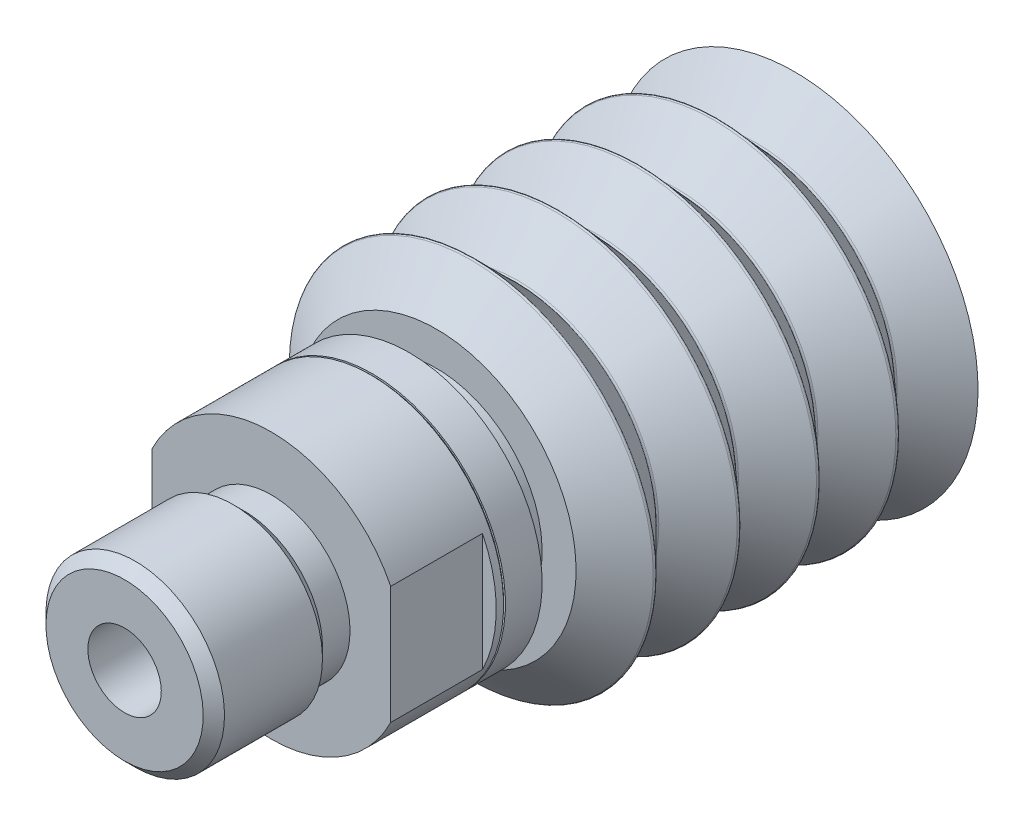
ISO-10303-21;
HEADER;
FILE_DESCRIPTION(('STEP AP214'),'2;1');
FILE_NAME('part.step','',(''),(''),'','','');
FILE_SCHEMA(('AUTOMOTIVE_DESIGN { 1 0 10303 214 1 1 1 1 }'));
ENDSEC;
DATA;
#1=APPLICATION_CONTEXT('core data for automotive mechanical design processes');
#2=APPLICATION_PROTOCOL_DEFINITION('international standard','automotive_design',2000,#1);
#3=PRODUCT_CONTEXT('',#1,'mechanical');
#4=PRODUCT('Part','Part','',(#3));
#5=PRODUCT_RELATED_PRODUCT_CATEGORY('part','',(#4));
#6=PRODUCT_DEFINITION_FORMATION('','',#4);
#7=PRODUCT_DEFINITION_CONTEXT('part definition',#1,'design');
#8=PRODUCT_DEFINITION('design','',#6,#7);
#9=PRODUCT_DEFINITION_SHAPE('','',#8);
#10=(LENGTH_UNIT() NAMED_UNIT(*) SI_UNIT(.MILLI.,.METRE.));
#11=(NAMED_UNIT(*) PLANE_ANGLE_UNIT() SI_UNIT($,.RADIAN.));
#12=(NAMED_UNIT(*) SI_UNIT($,.STERADIAN.) SOLID_ANGLE_UNIT());
#13=UNCERTAINTY_MEASURE_WITH_UNIT(LENGTH_MEASURE(1.E-05),#10,'distance_accuracy_value','');
#14=(GEOMETRIC_REPRESENTATION_CONTEXT(3) GLOBAL_UNCERTAINTY_ASSIGNED_CONTEXT((#13)) GLOBAL_UNIT_ASSIGNED_CONTEXT((#10,
#11,#12)) REPRESENTATION_CONTEXT('',''));
#15=CARTESIAN_POINT('',(0.,0.,0.));
#16=DIRECTION('',(0.,0.,1.));
#17=DIRECTION('',(1.,0.,0.));
#18=AXIS2_PLACEMENT_3D('',#15,#16,#17);
#19=CARTESIAN_POINT('',(6.5,-10.,28.5));
#20=DIRECTION('',(-1.,0.,0.));
#21=DIRECTION('',(0.,0.,1.));
#22=AXIS2_PLACEMENT_3D('',#19,#20,#21);
#23=PLANE('',#22);
#24=DIRECTION('',(0.,0.,1.));
#25=VECTOR('',#24,1.);
#26=CARTESIAN_POINT('',(6.5,3.21130814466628,23.));
#27=LINE('',#26,#25);
#28=CARTESIAN_POINT('',(6.5,3.21130814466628,23.5));
#29=VERTEX_POINT('',#28);
#30=CARTESIAN_POINT('',(6.5,3.21130814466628,28.5));
#31=VERTEX_POINT('',#30);
#32=EDGE_CURVE('E354',#29,#31,#27,.T.);
#33=ORIENTED_EDGE('',*,*,#32,.T.);
#34=DIRECTION('',(0.,-1.,0.));
#35=VECTOR('',#34,1.);
#36=CARTESIAN_POINT('',(6.5,0.,28.5));
#37=LINE('',#36,#35);
#38=CARTESIAN_POINT('',(6.5,-3.21130814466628,28.5));
#39=VERTEX_POINT('',#38);
#40=EDGE_CURVE('E254',#31,#39,#37,.T.);
#41=ORIENTED_EDGE('',*,*,#40,.T.);
#42=DIRECTION('',(0.,0.,-1.));
#43=VECTOR('',#42,1.);
#44=CARTESIAN_POINT('',(6.5,-3.21130814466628,23.));
#45=LINE('',#44,#43);
#46=CARTESIAN_POINT('',(6.5,-3.21130814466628,23.5));
#47=VERTEX_POINT('',#46);
#48=EDGE_CURVE('E273',#39,#47,#45,.T.);
#49=ORIENTED_EDGE('',*,*,#48,.T.);
#50=DIRECTION('',(0.,1.,0.));
#51=VECTOR('',#50,1.);
#52=CARTESIAN_POINT('',(6.5,-10.,23.5));
#53=LINE('',#52,#51);
#54=EDGE_CURVE('E10',#47,#29,#53,.T.);
#55=ORIENTED_EDGE('',*,*,#54,.T.);
#56=EDGE_LOOP('',(#33,#41,#49,#55));
#57=FACE_BOUND('',#56,.T.);
#58=ADVANCED_FACE('F15',(#57),#23,.F.);
#59=CARTESIAN_POINT('',(0.,0.,23.5));
#60=DIRECTION('',(0.,0.,1.));
#61=DIRECTION('',(-1.,0.,0.));
#62=AXIS2_PLACEMENT_3D('',#59,#60,#61);
#63=PLANE('',#62);
#64=ORIENTED_EDGE('',*,*,#54,.F.);
#65=CARTESIAN_POINT('',(0.,0.,23.5));
#66=DIRECTION('',(0.,0.,-1.));
#67=DIRECTION('',(0.,1.,0.));
#68=AXIS2_PLACEMENT_3D('',#65,#66,#67);
#69=CIRCLE('',#68,7.25);
#70=EDGE_CURVE('E277',#29,#47,#69,.T.);
#71=ORIENTED_EDGE('',*,*,#70,.F.);
#72=EDGE_LOOP('',(#64,#71));
#73=FACE_BOUND('',#72,.T.);
#74=ADVANCED_FACE('F538',(#73),#63,.T.);
#75=CARTESIAN_POINT('',(0.,0.,23.5));
#76=DIRECTION('',(0.,0.,1.));
#77=DIRECTION('',(-1.,0.,0.));
#78=AXIS2_PLACEMENT_3D('',#75,#76,#77);
#79=PLANE('',#78);
#80=DIRECTION('',(0.,-1.,0.));
#81=VECTOR('',#80,1.);
#82=CARTESIAN_POINT('',(-6.5,10.,23.5));
#83=LINE('',#82,#81);
#84=CARTESIAN_POINT('',(-6.5,3.21130814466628,23.5));
#85=VERTEX_POINT('',#84);
#86=CARTESIAN_POINT('',(-6.5,-3.21130814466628,23.5));
#87=VERTEX_POINT('',#86);
#88=EDGE_CURVE('E26',#85,#87,#83,.T.);
#89=ORIENTED_EDGE('',*,*,#88,.F.);
#90=CARTESIAN_POINT('',(0.,0.,23.5));
#91=DIRECTION('',(0.,0.,-1.));
#92=DIRECTION('',(0.,1.,0.));
#93=AXIS2_PLACEMENT_3D('',#90,#91,#92);
#94=CIRCLE('',#93,7.25);
#95=EDGE_CURVE('E389',#87,#85,#94,.T.);
#96=ORIENTED_EDGE('',*,*,#95,.F.);
#97=EDGE_LOOP('',(#89,#96));
#98=FACE_BOUND('',#97,.T.);
#99=ADVANCED_FACE('F536',(#98),#79,.T.);
#100=CARTESIAN_POINT('',(-6.5,10.,28.5));
#101=DIRECTION('',(1.,0.,0.));
#102=DIRECTION('',(0.,1.,0.));
#103=AXIS2_PLACEMENT_3D('',#100,#101,#102);
#104=PLANE('',#103);
#105=DIRECTION('',(0.,0.,1.));
#106=VECTOR('',#105,1.);
#107=CARTESIAN_POINT('',(-6.5,-3.21130814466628,23.));
#108=LINE('',#107,#106);
#109=CARTESIAN_POINT('',(-6.5,-3.21130814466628,28.5));
#110=VERTEX_POINT('',#109);
#111=EDGE_CURVE('E366',#87,#110,#108,.T.);
#112=ORIENTED_EDGE('',*,*,#111,.T.);
#113=DIRECTION('',(0.,1.,0.));
#114=VECTOR('',#113,1.);
#115=CARTESIAN_POINT('',(-6.5,0.,28.5));
#116=LINE('',#115,#114);
#117=CARTESIAN_POINT('',(-6.5,3.21130814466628,28.5));
#118=VERTEX_POINT('',#117);
#119=EDGE_CURVE('E256',#110,#118,#116,.T.);
#120=ORIENTED_EDGE('',*,*,#119,.T.);
#121=DIRECTION('',(0.,0.,-1.));
#122=VECTOR('',#121,1.);
#123=CARTESIAN_POINT('',(-6.5,3.21130814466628,23.));
#124=LINE('',#123,#122);
#125=EDGE_CURVE('E390',#118,#85,#124,.T.);
#126=ORIENTED_EDGE('',*,*,#125,.T.);
#127=ORIENTED_EDGE('',*,*,#88,.T.);
#128=EDGE_LOOP('',(#112,#120,#126,#127));
#129=FACE_BOUND('',#128,.T.);
#130=ADVANCED_FACE('F533',(#129),#104,.F.);
#131=CARTESIAN_POINT('',(0.,0.,35.919));
#132=DIRECTION('',(0.,0.,-1.));
#133=DIRECTION('',(0.,-1.,0.));
#134=AXIS2_PLACEMENT_3D('',#131,#132,#133);
#135=CONICAL_SURFACE('',#134,4.864,0.78539816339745);
#136=CARTESIAN_POINT('',(0.,0.,35.919));
#137=DIRECTION('',(0.,0.,-1.));
#138=DIRECTION('',(0.,-1.,0.));
#139=AXIS2_PLACEMENT_3D('',#136,#137,#138);
#140=CIRCLE('',#139,4.864);
#141=CARTESIAN_POINT('',(0.,-4.864,35.919));
#142=VERTEX_POINT('',#141);
#143=EDGE_CURVE('E38',#142,#142,#140,.T.);
#144=ORIENTED_EDGE('',*,*,#143,.F.);
#145=EDGE_LOOP('',(#144));
#146=FACE_BOUND('',#145,.T.);
#147=CARTESIAN_POINT('',(0.,0.,36.5));
#148=DIRECTION('',(0.,0.,-1.));
#149=DIRECTION('',(0.,-1.,0.));
#150=AXIS2_PLACEMENT_3D('',#147,#148,#149);
#151=CIRCLE('',#150,4.283);
#152=CARTESIAN_POINT('',(0.,-4.283,36.5));
#153=VERTEX_POINT('',#152);
#154=EDGE_CURVE('E367',#153,#153,#151,.T.);
#155=ORIENTED_EDGE('',*,*,#154,.T.);
#156=EDGE_LOOP('',(#155));
#157=FACE_BOUND('',#156,.T.);
#158=ADVANCED_FACE('F545',(#146,#157),#135,.T.);
#159=CARTESIAN_POINT('',(0.,0.,23.));
#160=DIRECTION('',(0.,0.,-1.));
#161=DIRECTION('',(0.,-1.,0.));
#162=AXIS2_PLACEMENT_3D('',#159,#160,#161);
#163=CYLINDRICAL_SURFACE('',#162,4.864);
#164=CARTESIAN_POINT('',(0.,0.,30.581));
#165=DIRECTION('',(0.,0.,-1.));
#166=DIRECTION('',(0.,-1.,0.));
#167=AXIS2_PLACEMENT_3D('',#164,#165,#166);
#168=CIRCLE('',#167,4.864);
#169=CARTESIAN_POINT('',(0.,-4.864,30.581));
#170=VERTEX_POINT('',#169);
#171=EDGE_CURVE('E278',#170,#170,#168,.T.);
#172=ORIENTED_EDGE('',*,*,#171,.F.);
#173=EDGE_LOOP('',(#172));
#174=FACE_BOUND('',#173,.T.);
#175=ORIENTED_EDGE('',*,*,#143,.T.);
#176=EDGE_LOOP('',(#175));
#177=FACE_BOUND('',#176,.T.);
#178=ADVANCED_FACE('F574',(#174,#177),#163,.T.);
#179=CARTESIAN_POINT('',(0.,0.,30.));
#180=DIRECTION('',(0.,0.,1.));
#181=DIRECTION('',(0.,1.,0.));
#182=AXIS2_PLACEMENT_3D('',#179,#180,#181);
#183=CONICAL_SURFACE('',#182,4.283,0.785398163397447);
#184=CARTESIAN_POINT('',(0.,0.,30.));
#185=DIRECTION('',(0.,0.,-1.));
#186=DIRECTION('',(0.,-1.,0.));
#187=AXIS2_PLACEMENT_3D('',#184,#185,#186);
#188=CIRCLE('',#187,4.283);
#189=CARTESIAN_POINT('',(0.,-4.283,30.));
#190=VERTEX_POINT('',#189);
#191=EDGE_CURVE('E260',#190,#190,#188,.T.);
#192=ORIENTED_EDGE('',*,*,#191,.F.);
#193=EDGE_LOOP('',(#192));
#194=FACE_BOUND('',#193,.T.);
#195=ORIENTED_EDGE('',*,*,#171,.T.);
#196=EDGE_LOOP('',(#195));
#197=FACE_BOUND('',#196,.T.);
#198=ADVANCED_FACE('F605',(#194,#197),#183,.T.);
#199=CARTESIAN_POINT('',(0.,0.,23.));
#200=DIRECTION('',(0.,0.,-1.));
#201=DIRECTION('',(0.,-1.,0.));
#202=AXIS2_PLACEMENT_3D('',#199,#200,#201);
#203=CYLINDRICAL_SURFACE('',#202,4.283);
#204=CARTESIAN_POINT('',(0.,0.,28.5));
#205=DIRECTION('',(0.,0.,-1.));
#206=DIRECTION('',(0.,-1.,0.));
#207=AXIS2_PLACEMENT_3D('',#204,#205,#206);
#208=CIRCLE('',#207,4.283);
#209=CARTESIAN_POINT('',(0.,-4.283,28.5));
#210=VERTEX_POINT('',#209);
#211=EDGE_CURVE('E251',#210,#210,#208,.T.);
#212=ORIENTED_EDGE('',*,*,#211,.F.);
#213=EDGE_LOOP('',(#212));
#214=FACE_BOUND('',#213,.T.);
#215=ORIENTED_EDGE('',*,*,#191,.T.);
#216=EDGE_LOOP('',(#215));
#217=FACE_BOUND('',#216,.T.);
#218=ADVANCED_FACE('F610',(#214,#217),#203,.T.);
#219=CARTESIAN_POINT('',(-7.25,0.,28.5));
#220=DIRECTION('',(0.,0.,1.));
#221=DIRECTION('',(-1.,0.,0.));
#222=AXIS2_PLACEMENT_3D('',#219,#220,#221);
#223=PLANE('',#222);
#224=ORIENTED_EDGE('',*,*,#40,.F.);
#225=CARTESIAN_POINT('',(0.,0.,28.5));
#226=DIRECTION('',(0.,0.,-1.));
#227=DIRECTION('',(0.,-1.,0.));
#228=AXIS2_PLACEMENT_3D('',#225,#226,#227);
#229=CIRCLE('',#228,7.25);
#230=EDGE_CURVE('E394',#118,#31,#229,.T.);
#231=ORIENTED_EDGE('',*,*,#230,.F.);
#232=ORIENTED_EDGE('',*,*,#119,.F.);
#233=CARTESIAN_POINT('',(0.,0.,28.5));
#234=DIRECTION('',(0.,0.,-1.));
#235=DIRECTION('',(0.,-1.,0.));
#236=AXIS2_PLACEMENT_3D('',#233,#234,#235);
#237=CIRCLE('',#236,7.25);
#238=EDGE_CURVE('E255',#39,#110,#237,.T.);
#239=ORIENTED_EDGE('',*,*,#238,.F.);
#240=EDGE_LOOP('',(#224,#231,#232,#239));
#241=FACE_BOUND('',#240,.T.);
#242=ORIENTED_EDGE('',*,*,#211,.T.);
#243=EDGE_LOOP('',(#242));
#244=FACE_BOUND('',#243,.T.);
#245=ADVANCED_FACE('F525',(#241,#244),#223,.T.);
#246=CARTESIAN_POINT('',(0.,0.,23.));
#247=DIRECTION('',(0.,0.,-1.));
#248=DIRECTION('',(0.,-1.,0.));
#249=AXIS2_PLACEMENT_3D('',#246,#247,#248);
#250=CYLINDRICAL_SURFACE('',#249,7.25);
#251=CARTESIAN_POINT('',(0.,0.,23.1));
#252=DIRECTION('',(0.,0.,-1.));
#253=DIRECTION('',(0.,-1.,0.));
#254=AXIS2_PLACEMENT_3D('',#251,#252,#253);
#255=CIRCLE('',#254,7.25);
#256=CARTESIAN_POINT('',(0.,-7.25,23.1));
#257=VERTEX_POINT('',#256);
#258=EDGE_CURVE('E363',#257,#257,#255,.T.);
#259=ORIENTED_EDGE('',*,*,#258,.F.);
#260=EDGE_LOOP('',(#259));
#261=FACE_BOUND('',#260,.T.);
#262=ORIENTED_EDGE('',*,*,#111,.F.);
#263=ORIENTED_EDGE('',*,*,#95,.T.);
#264=ORIENTED_EDGE('',*,*,#125,.F.);
#265=ORIENTED_EDGE('',*,*,#230,.T.);
#266=ORIENTED_EDGE('',*,*,#32,.F.);
#267=ORIENTED_EDGE('',*,*,#70,.T.);
#268=ORIENTED_EDGE('',*,*,#48,.F.);
#269=ORIENTED_EDGE('',*,*,#238,.T.);
#270=EDGE_LOOP('',(#262,#263,#264,#265,#266,#267,#268,#269));
#271=FACE_BOUND('',#270,.T.);
#272=ADVANCED_FACE('F519',(#261,#271),#250,.T.);
#273=CARTESIAN_POINT('',(0.,0.,23.));
#274=DIRECTION('',(0.,0.,1.));
#275=DIRECTION('',(0.,1.,0.));
#276=AXIS2_PLACEMENT_3D('',#273,#274,#275);
#277=CONICAL_SURFACE('',#276,7.15,0.78539816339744);
#278=CARTESIAN_POINT('',(0.,0.,23.));
#279=DIRECTION('',(0.,0.,-1.));
#280=DIRECTION('',(0.,-1.,0.));
#281=AXIS2_PLACEMENT_3D('',#278,#279,#280);
#282=CIRCLE('',#281,7.15);
#283=CARTESIAN_POINT('',(0.,-7.15,23.));
#284=VERTEX_POINT('',#283);
#285=EDGE_CURVE('E358',#284,#284,#282,.T.);
#286=ORIENTED_EDGE('',*,*,#285,.F.);
#287=EDGE_LOOP('',(#286));
#288=FACE_BOUND('',#287,.T.);
#289=ORIENTED_EDGE('',*,*,#258,.T.);
#290=EDGE_LOOP('',(#289));
#291=FACE_BOUND('',#290,.T.);
#292=ADVANCED_FACE('F515',(#288,#291),#277,.T.);
#293=CARTESIAN_POINT('',(0.,0.,23.));
#294=DIRECTION('',(0.,0.,-1.));
#295=DIRECTION('',(0.,-1.,0.));
#296=AXIS2_PLACEMENT_3D('',#293,#294,#295);
#297=CYLINDRICAL_SURFACE('',#296,2.);
#298=CARTESIAN_POINT('',(0.,0.,36.5));
#299=DIRECTION('',(0.,0.,-1.));
#300=DIRECTION('',(0.,-1.,0.));
#301=AXIS2_PLACEMENT_3D('',#298,#299,#300);
#302=CIRCLE('',#301,2.);
#303=CARTESIAN_POINT('',(0.,-2.,36.5));
#304=VERTEX_POINT('',#303);
#305=EDGE_CURVE('E345',#304,#304,#302,.T.);
#306=ORIENTED_EDGE('',*,*,#305,.F.);
#307=EDGE_LOOP('',(#306));
#308=FACE_BOUND('',#307,.T.);
#309=CARTESIAN_POINT('',(0.,0.,23.));
#310=DIRECTION('',(0.,0.,-1.));
#311=DIRECTION('',(0.,-1.,0.));
#312=AXIS2_PLACEMENT_3D('',#309,#310,#311);
#313=CIRCLE('',#312,2.);
#314=CARTESIAN_POINT('',(0.,-2.,23.));
#315=VERTEX_POINT('',#314);
#316=EDGE_CURVE('E342',#315,#315,#313,.T.);
#317=ORIENTED_EDGE('',*,*,#316,.T.);
#318=EDGE_LOOP('',(#317));
#319=FACE_BOUND('',#318,.T.);
#320=ADVANCED_FACE('F518',(#308,#319),#297,.F.);
#321=CARTESIAN_POINT('',(-4.283,0.,36.5));
#322=DIRECTION('',(0.,0.,1.));
#323=DIRECTION('',(-1.,0.,0.));
#324=AXIS2_PLACEMENT_3D('',#321,#322,#323);
#325=PLANE('',#324);
#326=ORIENTED_EDGE('',*,*,#154,.F.);
#327=EDGE_LOOP('',(#326));
#328=FACE_BOUND('',#327,.T.);
#329=ORIENTED_EDGE('',*,*,#305,.T.);
#330=EDGE_LOOP('',(#329));
#331=FACE_BOUND('',#330,.T.);
#332=ADVANCED_FACE('F647',(#328,#331),#325,.T.);
#333=CARTESIAN_POINT('',(-2.,0.,23.));
#334=DIRECTION('',(0.,0.,-1.));
#335=DIRECTION('',(0.,-1.,0.));
#336=AXIS2_PLACEMENT_3D('',#333,#334,#335);
#337=PLANE('',#336);
#338=ORIENTED_EDGE('',*,*,#316,.F.);
#339=EDGE_LOOP('',(#338));
#340=FACE_BOUND('',#339,.T.);
#341=CARTESIAN_POINT('',(0.,0.,23.));
#342=DIRECTION('',(0.,0.,-1.));
#343=DIRECTION('',(0.,-1.,0.));
#344=AXIS2_PLACEMENT_3D('',#341,#342,#343);
#345=CIRCLE('',#344,2.5);
#346=CARTESIAN_POINT('',(0.,-2.5,23.));
#347=VERTEX_POINT('',#346);
#348=EDGE_CURVE('E346',#347,#347,#345,.T.);
#349=ORIENTED_EDGE('',*,*,#348,.T.);
#350=EDGE_LOOP('',(#349));
#351=FACE_BOUND('',#350,.T.);
#352=ADVANCED_FACE('F17',(#340,#351),#337,.T.);
#353=CARTESIAN_POINT('',(0.,0.,0.));
#354=DIRECTION('',(0.,0.,-1.));
#355=DIRECTION('',(0.,-1.,0.));
#356=AXIS2_PLACEMENT_3D('',#353,#354,#355);
#357=CYLINDRICAL_SURFACE('',#356,2.5);
#358=ORIENTED_EDGE('',*,*,#348,.F.);
#359=EDGE_LOOP('',(#358));
#360=FACE_BOUND('',#359,.T.);
#361=CARTESIAN_POINT('',(0.,0.,21.));
#362=DIRECTION('',(0.,0.,-1.));
#363=DIRECTION('',(0.,-1.,0.));
#364=AXIS2_PLACEMENT_3D('',#361,#362,#363);
#365=CIRCLE('',#364,2.5);
#366=CARTESIAN_POINT('',(0.,-2.5,21.));
#367=VERTEX_POINT('',#366);
#368=EDGE_CURVE('E250',#367,#367,#365,.T.);
#369=ORIENTED_EDGE('',*,*,#368,.T.);
#370=EDGE_LOOP('',(#369));
#371=FACE_BOUND('',#370,.T.);
#372=ADVANCED_FACE('F444',(#360,#371),#357,.F.);
#373=CARTESIAN_POINT('',(-7.25,0.,23.));
#374=DIRECTION('',(0.,0.,1.));
#375=DIRECTION('',(-1.,0.,0.));
#376=AXIS2_PLACEMENT_3D('',#373,#374,#375);
#377=PLANE('',#376);
#378=CARTESIAN_POINT('',(0.,0.,23.));
#379=DIRECTION('',(0.,0.,-1.));
#380=DIRECTION('',(0.,-1.,0.));
#381=AXIS2_PLACEMENT_3D('',#378,#379,#380);
#382=CIRCLE('',#381,7.25);
#383=CARTESIAN_POINT('',(0.,-7.25,23.));
#384=VERTEX_POINT('',#383);
#385=EDGE_CURVE('E292',#384,#384,#382,.T.);
#386=ORIENTED_EDGE('',*,*,#385,.F.);
#387=EDGE_LOOP('',(#386));
#388=FACE_BOUND('',#387,.T.);
#389=ORIENTED_EDGE('',*,*,#285,.T.);
#390=EDGE_LOOP('',(#389));
#391=FACE_BOUND('',#390,.T.);
#392=ADVANCED_FACE('F447',(#388,#391),#377,.T.);
#393=CARTESIAN_POINT('',(0.,0.,0.));
#394=DIRECTION('',(0.,0.,-1.));
#395=DIRECTION('',(0.,-1.,0.));
#396=AXIS2_PLACEMENT_3D('',#393,#394,#395);
#397=CYLINDRICAL_SURFACE('',#396,7.25);
#398=CARTESIAN_POINT('',(0.,0.,21.));
#399=DIRECTION('',(0.,0.,-1.));
#400=DIRECTION('',(0.,-1.,0.));
#401=AXIS2_PLACEMENT_3D('',#398,#399,#400);
#402=CIRCLE('',#401,7.25);
#403=CARTESIAN_POINT('',(0.,-7.25,21.));
#404=VERTEX_POINT('',#403);
#405=EDGE_CURVE('E288',#404,#404,#402,.T.);
#406=ORIENTED_EDGE('',*,*,#405,.F.);
#407=EDGE_LOOP('',(#406));
#408=FACE_BOUND('',#407,.T.);
#409=ORIENTED_EDGE('',*,*,#385,.T.);
#410=EDGE_LOOP('',(#409));
#411=FACE_BOUND('',#410,.T.);
#412=ADVANCED_FACE('F497',(#408,#411),#397,.T.);
#413=CARTESIAN_POINT('',(-5.75,0.,21.));
#414=DIRECTION('',(0.,0.,-1.));
#415=DIRECTION('',(0.,-1.,0.));
#416=AXIS2_PLACEMENT_3D('',#413,#414,#415);
#417=PLANE('',#416);
#418=CARTESIAN_POINT('',(0.,0.,21.));
#419=DIRECTION('',(0.,0.,-1.));
#420=DIRECTION('',(0.,-1.,0.));
#421=AXIS2_PLACEMENT_3D('',#418,#419,#420);
#422=CIRCLE('',#421,5.75);
#423=CARTESIAN_POINT('',(0.,-5.75,21.));
#424=VERTEX_POINT('',#423);
#425=EDGE_CURVE('E293',#424,#424,#422,.T.);
#426=ORIENTED_EDGE('',*,*,#425,.F.);
#427=EDGE_LOOP('',(#426));
#428=FACE_BOUND('',#427,.T.);
#429=ORIENTED_EDGE('',*,*,#405,.T.);
#430=EDGE_LOOP('',(#429));
#431=FACE_BOUND('',#430,.T.);
#432=ADVANCED_FACE('F491',(#428,#431),#417,.T.);
#433=CARTESIAN_POINT('',(0.,0.,0.));
#434=DIRECTION('',(0.,0.,-1.));
#435=DIRECTION('',(0.,-1.,0.));
#436=AXIS2_PLACEMENT_3D('',#433,#434,#435);
#437=CYLINDRICAL_SURFACE('',#436,5.75);
#438=CARTESIAN_POINT('',(0.,0.,19.5));
#439=DIRECTION('',(0.,0.,-1.));
#440=DIRECTION('',(0.,-1.,0.));
#441=AXIS2_PLACEMENT_3D('',#438,#439,#440);
#442=CIRCLE('',#441,5.75);
#443=CARTESIAN_POINT('',(0.,-5.75,19.5));
#444=VERTEX_POINT('',#443);
#445=EDGE_CURVE('E294',#444,#444,#442,.T.);
#446=ORIENTED_EDGE('',*,*,#445,.F.);
#447=EDGE_LOOP('',(#446));
#448=FACE_BOUND('',#447,.T.);
#449=ORIENTED_EDGE('',*,*,#425,.T.);
#450=EDGE_LOOP('',(#449));
#451=FACE_BOUND('',#450,.T.);
#452=ADVANCED_FACE('F485',(#448,#451),#437,.T.);
#453=CARTESIAN_POINT('',(-7.6,0.,19.5));
#454=DIRECTION('',(0.,0.,1.));
#455=DIRECTION('',(-1.,0.,0.));
#456=AXIS2_PLACEMENT_3D('',#453,#454,#455);
#457=PLANE('',#456);
#458=CARTESIAN_POINT('',(0.,0.,19.5));
#459=DIRECTION('',(0.,0.,-1.));
#460=DIRECTION('',(0.,-1.,0.));
#461=AXIS2_PLACEMENT_3D('',#458,#459,#460);
#462=CIRCLE('',#461,7.6);
#463=CARTESIAN_POINT('',(0.,-7.6,19.5));
#464=VERTEX_POINT('',#463);
#465=EDGE_CURVE('E297',#464,#464,#462,.T.);
#466=ORIENTED_EDGE('',*,*,#465,.F.);
#467=EDGE_LOOP('',(#466));
#468=FACE_BOUND('',#467,.T.);
#469=ORIENTED_EDGE('',*,*,#445,.T.);
#470=EDGE_LOOP('',(#469));
#471=FACE_BOUND('',#470,.T.);
#472=ADVANCED_FACE('F482',(#468,#471),#457,.T.);
#473=CARTESIAN_POINT('',(0.,0.,17.6112335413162));
#474=DIRECTION('',(0.,0.,-1.));
#475=DIRECTION('',(0.,-1.,0.));
#476=AXIS2_PLACEMENT_3D('',#473,#474,#475);
#477=CONICAL_SURFACE('',#476,9.91428703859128,0.886295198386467);
#478=CARTESIAN_POINT('',(0.,0.,17.6112335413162));
#479=DIRECTION('',(0.,0.,-1.));
#480=DIRECTION('',(0.,-1.,0.));
#481=AXIS2_PLACEMENT_3D('',#478,#479,#480);
#482=CIRCLE('',#481,9.91428703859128);
#483=CARTESIAN_POINT('',(0.,-9.91428703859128,17.6112335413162));
#484=VERTEX_POINT('',#483);
#485=EDGE_CURVE('E407',#484,#484,#482,.T.);
#486=ORIENTED_EDGE('',*,*,#485,.F.);
#487=EDGE_LOOP('',(#486));
#488=FACE_BOUND('',#487,.T.);
#489=ORIENTED_EDGE('',*,*,#465,.T.);
#490=EDGE_LOOP('',(#489));
#491=FACE_BOUND('',#490,.T.);
#492=ADVANCED_FACE('F480',(#488,#491),#477,.T.);
#493=CARTESIAN_POINT('',(0.,0.,17.5337600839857));
#494=DIRECTION('',(0.,0.,-1.));
#495=DIRECTION('',(0.,-1.,0.));
#496=AXIS2_PLACEMENT_3D('',#493,#494,#495);
#497=TOROIDAL_SURFACE('',#496,9.85105837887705,0.1);
#498=CARTESIAN_POINT('',(0.,0.,17.4630494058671));
#499=DIRECTION('',(0.,0.,-1.));
#500=DIRECTION('',(0.,-1.,0.));
#501=AXIS2_PLACEMENT_3D('',#498,#499,#500);
#502=CIRCLE('',#501,9.92176905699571);
#503=CARTESIAN_POINT('',(0.,-9.92176905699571,17.4630494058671));
#504=VERTEX_POINT('',#503);
#505=EDGE_CURVE('E403',#504,#504,#502,.T.);
#506=ORIENTED_EDGE('',*,*,#505,.F.);
#507=EDGE_LOOP('',(#506));
#508=FACE_BOUND('',#507,.T.);
#509=ORIENTED_EDGE('',*,*,#485,.T.);
#510=EDGE_LOOP('',(#509));
#511=FACE_BOUND('',#510,.T.);
#512=ADVANCED_FACE('F589',(#508,#511),#497,.T.);
#513=CARTESIAN_POINT('',(0.,0.,15.2081678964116));
#514=DIRECTION('',(0.,0.,1.));
#515=DIRECTION('',(0.,1.,0.));
#516=AXIS2_PLACEMENT_3D('',#513,#514,#515);
#517=CONICAL_SURFACE('',#516,7.6668875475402,0.785398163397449);
#518=CARTESIAN_POINT('',(0.,0.,15.2081678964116));
#519=DIRECTION('',(0.,0.,-1.));
#520=DIRECTION('',(0.,-1.,0.));
#521=AXIS2_PLACEMENT_3D('',#518,#519,#520);
#522=CIRCLE('',#521,7.6668875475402);
#523=CARTESIAN_POINT('',(0.,-7.6668875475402,15.2081678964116));
#524=VERTEX_POINT('',#523);
#525=EDGE_CURVE('E239',#524,#524,#522,.T.);
#526=ORIENTED_EDGE('',*,*,#525,.F.);
#527=EDGE_LOOP('',(#526));
#528=FACE_BOUND('',#527,.T.);
#529=ORIENTED_EDGE('',*,*,#505,.T.);
#530=EDGE_LOOP('',(#529));
#531=FACE_BOUND('',#530,.T.);
#532=ADVANCED_FACE('F672',(#528,#531),#517,.T.);
#533=CARTESIAN_POINT('',(0.,0.,15.1374572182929));
#534=DIRECTION('',(0.,0.,-1.));
#535=DIRECTION('',(0.,-1.,0.));
#536=AXIS2_PLACEMENT_3D('',#533,#534,#535);
#537=TOROIDAL_SURFACE('',#536,7.73759822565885,0.0999999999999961);
#538=ORIENTED_EDGE('',*,*,#525,.T.);
#539=EDGE_LOOP('',(#538));
#540=FACE_BOUND('',#539,.T.);
#541=CARTESIAN_POINT('',(0.,0.,15.0631427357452));
#542=DIRECTION('',(0.,0.,-1.));
#543=DIRECTION('',(0.,-1.,0.));
#544=AXIS2_PLACEMENT_3D('',#541,#542,#543);
#545=CIRCLE('',#544,7.67068516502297);
#546=CARTESIAN_POINT('',(0.,-7.67068516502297,15.0631427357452));
#547=VERTEX_POINT('',#546);
#548=EDGE_CURVE('E232',#547,#547,#545,.T.);
#549=ORIENTED_EDGE('',*,*,#548,.F.);
#550=EDGE_LOOP('',(#549));
#551=FACE_BOUND('',#550,.T.);
#552=ADVANCED_FACE('F704',(#540,#551),#537,.F.);
#553=CARTESIAN_POINT('',(0.,0.,13.0401327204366));
#554=DIRECTION('',(0.,0.,-1.));
#555=DIRECTION('',(0.,-1.,0.));
#556=AXIS2_PLACEMENT_3D('',#553,#554,#555);
#557=CONICAL_SURFACE('',#556,9.91746540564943,0.837758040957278);
#558=CARTESIAN_POINT('',(0.,0.,13.0401327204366));
#559=DIRECTION('',(0.,0.,-1.));
#560=DIRECTION('',(0.,-1.,0.));
#561=AXIS2_PLACEMENT_3D('',#558,#559,#560);
#562=CIRCLE('',#561,9.91746540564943);
#563=CARTESIAN_POINT('',(0.,-9.91746540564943,13.0401327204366));
#564=VERTEX_POINT('',#563);
#565=EDGE_CURVE('E228',#564,#564,#562,.T.);
#566=ORIENTED_EDGE('',*,*,#565,.F.);
#567=EDGE_LOOP('',(#566));
#568=FACE_BOUND('',#567,.T.);
#569=ORIENTED_EDGE('',*,*,#548,.T.);
#570=EDGE_LOOP('',(#569));
#571=FACE_BOUND('',#570,.T.);
#572=ADVANCED_FACE('F702',(#568,#571),#557,.T.);
#573=CARTESIAN_POINT('',(0.,0.,12.9658182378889));
#574=DIRECTION('',(0.,0.,-1.));
#575=DIRECTION('',(0.,-1.,0.));
#576=AXIS2_PLACEMENT_3D('',#573,#574,#575);
#577=TOROIDAL_SURFACE('',#576,9.85055234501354,0.1);
#578=CARTESIAN_POINT('',(0.,0.,12.8915037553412));
#579=DIRECTION('',(0.,0.,-1.));
#580=DIRECTION('',(0.,-1.,0.));
#581=AXIS2_PLACEMENT_3D('',#578,#579,#580);
#582=CIRCLE('',#581,9.91746540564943);
#583=CARTESIAN_POINT('',(0.,-9.91746540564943,12.8915037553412));
#584=VERTEX_POINT('',#583);
#585=EDGE_CURVE('E19',#584,#584,#582,.T.);
#586=ORIENTED_EDGE('',*,*,#585,.F.);
#587=EDGE_LOOP('',(#586));
#588=FACE_BOUND('',#587,.T.);
#589=ORIENTED_EDGE('',*,*,#565,.T.);
#590=EDGE_LOOP('',(#589));
#591=FACE_BOUND('',#590,.T.);
#592=ADVANCED_FACE('F229',(#588,#591),#577,.T.);
#593=CARTESIAN_POINT('',(0.,0.,10.8791630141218));
#594=DIRECTION('',(0.,0.,1.));
#595=DIRECTION('',(0.,1.,0.));
#596=AXIS2_PLACEMENT_3D('',#593,#594,#595);
#597=CONICAL_SURFACE('',#596,7.68253459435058,0.837758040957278);
#598=CARTESIAN_POINT('',(0.,0.,10.8791630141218));
#599=DIRECTION('',(0.,0.,-1.));
#600=DIRECTION('',(0.,-1.,0.));
#601=AXIS2_PLACEMENT_3D('',#598,#599,#600);
#602=CIRCLE('',#601,7.68253459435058);
#603=CARTESIAN_POINT('',(0.,-7.68253459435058,10.8791630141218));
#604=VERTEX_POINT('',#603);
#605=EDGE_CURVE('E242',#604,#604,#602,.T.);
#606=ORIENTED_EDGE('',*,*,#605,.F.);
#607=EDGE_LOOP('',(#606));
#608=FACE_BOUND('',#607,.T.);
#609=ORIENTED_EDGE('',*,*,#585,.T.);
#610=EDGE_LOOP('',(#609));
#611=FACE_BOUND('',#610,.T.);
#612=ADVANCED_FACE('F661',(#608,#611),#597,.T.);
#613=CARTESIAN_POINT('',(0.,0.,10.8048485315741));
#614=DIRECTION('',(0.,0.,-1.));
#615=DIRECTION('',(0.,-1.,0.));
#616=AXIS2_PLACEMENT_3D('',#613,#614,#615);
#617=TOROIDAL_SURFACE('',#616,7.74944765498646,0.1);
#618=ORIENTED_EDGE('',*,*,#605,.T.);
#619=EDGE_LOOP('',(#618));
#620=FACE_BOUND('',#619,.T.);
#621=CARTESIAN_POINT('',(0.,0.,10.7305340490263));
#622=DIRECTION('',(0.,0.,-1.));
#623=DIRECTION('',(0.,-1.,0.));
#624=AXIS2_PLACEMENT_3D('',#621,#622,#623);
#625=CIRCLE('',#624,7.68253459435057);
#626=CARTESIAN_POINT('',(0.,-7.68253459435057,10.7305340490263));
#627=VERTEX_POINT('',#626);
#628=EDGE_CURVE('E284',#627,#627,#625,.T.);
#629=ORIENTED_EDGE('',*,*,#628,.F.);
#630=EDGE_LOOP('',(#629));
#631=FACE_BOUND('',#630,.T.);
#632=ADVANCED_FACE('F653',(#620,#631),#617,.F.);
#633=CARTESIAN_POINT('',(0.,0.,8.71819330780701));
#634=DIRECTION('',(0.,0.,-1.));
#635=DIRECTION('',(0.,-1.,0.));
#636=AXIS2_PLACEMENT_3D('',#633,#634,#635);
#637=CONICAL_SURFACE('',#636,9.91746540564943,0.837758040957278);
#638=CARTESIAN_POINT('',(0.,0.,8.71819330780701));
#639=DIRECTION('',(0.,0.,-1.));
#640=DIRECTION('',(0.,-1.,0.));
#641=AXIS2_PLACEMENT_3D('',#638,#639,#640);
#642=CIRCLE('',#641,9.91746540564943);
#643=CARTESIAN_POINT('',(0.,-9.91746540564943,8.71819330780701));
#644=VERTEX_POINT('',#643);
#645=EDGE_CURVE('E281',#644,#644,#642,.T.);
#646=ORIENTED_EDGE('',*,*,#645,.F.);
#647=EDGE_LOOP('',(#646));
#648=FACE_BOUND('',#647,.T.);
#649=ORIENTED_EDGE('',*,*,#628,.T.);
#650=EDGE_LOOP('',(#649));
#651=FACE_BOUND('',#650,.T.);
#652=ADVANCED_FACE('F649',(#648,#651),#637,.T.);
#653=CARTESIAN_POINT('',(0.,0.,8.64387882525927));
#654=DIRECTION('',(0.,0.,-1.));
#655=DIRECTION('',(0.,-1.,0.));
#656=AXIS2_PLACEMENT_3D('',#653,#654,#655);
#657=TOROIDAL_SURFACE('',#656,9.85055234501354,0.1);
#658=CARTESIAN_POINT('',(0.,0.,8.56956434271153));
#659=DIRECTION('',(0.,0.,-1.));
#660=DIRECTION('',(0.,-1.,0.));
#661=AXIS2_PLACEMENT_3D('',#658,#659,#660);
#662=CIRCLE('',#661,9.91746540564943);
#663=CARTESIAN_POINT('',(0.,-9.91746540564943,8.56956434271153));
#664=VERTEX_POINT('',#663);
#665=EDGE_CURVE('E131',#664,#664,#662,.T.);
#666=ORIENTED_EDGE('',*,*,#665,.F.);
#667=EDGE_LOOP('',(#666));
#668=FACE_BOUND('',#667,.T.);
#669=ORIENTED_EDGE('',*,*,#645,.T.);
#670=EDGE_LOOP('',(#669));
#671=FACE_BOUND('',#670,.T.);
#672=ADVANCED_FACE('F652',(#668,#671),#657,.T.);
#673=CARTESIAN_POINT('',(0.,0.,6.55722360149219));
#674=DIRECTION('',(0.,0.,1.));
#675=DIRECTION('',(0.,1.,0.));
#676=AXIS2_PLACEMENT_3D('',#673,#674,#675);
#677=CONICAL_SURFACE('',#676,7.68253459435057,0.837758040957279);
#678=CARTESIAN_POINT('',(0.,0.,6.55722360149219));
#679=DIRECTION('',(0.,0.,-1.));
#680=DIRECTION('',(0.,-1.,0.));
#681=AXIS2_PLACEMENT_3D('',#678,#679,#680);
#682=CIRCLE('',#681,7.68253459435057);
#683=CARTESIAN_POINT('',(0.,-7.68253459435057,6.55722360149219));
#684=VERTEX_POINT('',#683);
#685=EDGE_CURVE('E121',#684,#684,#682,.T.);
#686=ORIENTED_EDGE('',*,*,#685,.F.);
#687=EDGE_LOOP('',(#686));
#688=FACE_BOUND('',#687,.T.);
#689=ORIENTED_EDGE('',*,*,#665,.T.);
#690=EDGE_LOOP('',(#689));
#691=FACE_BOUND('',#690,.T.);
#692=ADVANCED_FACE('F571',(#688,#691),#677,.T.);
#693=CARTESIAN_POINT('',(0.,0.,6.48290911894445));
#694=DIRECTION('',(0.,0.,-1.));
#695=DIRECTION('',(0.,-1.,0.));
#696=AXIS2_PLACEMENT_3D('',#693,#694,#695);
#697=TOROIDAL_SURFACE('',#696,7.74944765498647,0.100000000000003);
#698=ORIENTED_EDGE('',*,*,#685,.T.);
#699=EDGE_LOOP('',(#698));
#700=FACE_BOUND('',#699,.T.);
#701=CARTESIAN_POINT('',(0.,0.,6.40859463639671));
#702=DIRECTION('',(0.,0.,-1.));
#703=DIRECTION('',(0.,-1.,0.));
#704=AXIS2_PLACEMENT_3D('',#701,#702,#703);
#705=CIRCLE('',#704,7.68253459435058);
#706=CARTESIAN_POINT('',(0.,-7.68253459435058,6.40859463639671));
#707=VERTEX_POINT('',#706);
#708=EDGE_CURVE('E338',#707,#707,#705,.T.);
#709=ORIENTED_EDGE('',*,*,#708,.F.);
#710=EDGE_LOOP('',(#709));
#711=FACE_BOUND('',#710,.T.);
#712=ADVANCED_FACE('F561',(#700,#711),#697,.F.);
#713=CARTESIAN_POINT('',(0.,0.,4.39625389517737));
#714=DIRECTION('',(0.,0.,-1.));
#715=DIRECTION('',(0.,-1.,0.));
#716=AXIS2_PLACEMENT_3D('',#713,#714,#715);
#717=CONICAL_SURFACE('',#716,9.91746540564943,0.837758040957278);
#718=CARTESIAN_POINT('',(0.,0.,4.39625389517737));
#719=DIRECTION('',(0.,0.,-1.));
#720=DIRECTION('',(0.,-1.,0.));
#721=AXIS2_PLACEMENT_3D('',#718,#719,#720);
#722=CIRCLE('',#721,9.91746540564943);
#723=CARTESIAN_POINT('',(0.,-9.91746540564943,4.39625389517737));
#724=VERTEX_POINT('',#723);
#725=EDGE_CURVE('E341',#724,#724,#722,.T.);
#726=ORIENTED_EDGE('',*,*,#725,.F.);
#727=EDGE_LOOP('',(#726));
#728=FACE_BOUND('',#727,.T.);
#729=ORIENTED_EDGE('',*,*,#708,.T.);
#730=EDGE_LOOP('',(#729));
#731=FACE_BOUND('',#730,.T.);
#732=ADVANCED_FACE('F557',(#728,#731),#717,.T.);
#733=CARTESIAN_POINT('',(0.,0.,4.32193941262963));
#734=DIRECTION('',(0.,0.,-1.));
#735=DIRECTION('',(0.,-1.,0.));
#736=AXIS2_PLACEMENT_3D('',#733,#734,#735);
#737=TOROIDAL_SURFACE('',#736,9.85055234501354,0.100000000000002);
#738=CARTESIAN_POINT('',(0.,0.,4.24762493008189));
#739=DIRECTION('',(0.,0.,-1.));
#740=DIRECTION('',(0.,-1.,0.));
#741=AXIS2_PLACEMENT_3D('',#738,#739,#740);
#742=CIRCLE('',#741,9.91746540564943);
#743=CARTESIAN_POINT('',(0.,-9.91746540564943,4.24762493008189));
#744=VERTEX_POINT('',#743);
#745=EDGE_CURVE('E350',#744,#744,#742,.T.);
#746=ORIENTED_EDGE('',*,*,#745,.F.);
#747=EDGE_LOOP('',(#746));
#748=FACE_BOUND('',#747,.T.);
#749=ORIENTED_EDGE('',*,*,#725,.T.);
#750=EDGE_LOOP('',(#749));
#751=FACE_BOUND('',#750,.T.);
#752=ADVANCED_FACE('F560',(#748,#751),#737,.T.);
#753=CARTESIAN_POINT('',(0.,0.,2.23528418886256));
#754=DIRECTION('',(0.,0.,1.));
#755=DIRECTION('',(0.,1.,0.));
#756=AXIS2_PLACEMENT_3D('',#753,#754,#755);
#757=CONICAL_SURFACE('',#756,7.68253459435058,0.837758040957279);
#758=CARTESIAN_POINT('',(0.,0.,2.23528418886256));
#759=DIRECTION('',(0.,0.,-1.));
#760=DIRECTION('',(0.,-1.,0.));
#761=AXIS2_PLACEMENT_3D('',#758,#759,#760);
#762=CIRCLE('',#761,7.68253459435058);
#763=CARTESIAN_POINT('',(0.,-7.68253459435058,2.23528418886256));
#764=VERTEX_POINT('',#763);
#765=EDGE_CURVE('E271',#764,#764,#762,.T.);
#766=ORIENTED_EDGE('',*,*,#765,.F.);
#767=EDGE_LOOP('',(#766));
#768=FACE_BOUND('',#767,.T.);
#769=ORIENTED_EDGE('',*,*,#745,.T.);
#770=EDGE_LOOP('',(#769));
#771=FACE_BOUND('',#770,.T.);
#772=ADVANCED_FACE('F677',(#768,#771),#757,.T.);
#773=CARTESIAN_POINT('',(0.,0.,2.16096970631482));
#774=DIRECTION('',(0.,0.,-1.));
#775=DIRECTION('',(0.,-1.,0.));
#776=AXIS2_PLACEMENT_3D('',#773,#774,#775);
#777=TOROIDAL_SURFACE('',#776,7.74944765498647,0.100000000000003);
#778=ORIENTED_EDGE('',*,*,#765,.T.);
#779=EDGE_LOOP('',(#778));
#780=FACE_BOUND('',#779,.T.);
#781=CARTESIAN_POINT('',(0.,0.,2.08665522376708));
#782=DIRECTION('',(0.,0.,-1.));
#783=DIRECTION('',(0.,-1.,0.));
#784=AXIS2_PLACEMENT_3D('',#781,#782,#783);
#785=CIRCLE('',#784,7.68253459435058);
#786=CARTESIAN_POINT('',(0.,-7.68253459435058,2.08665522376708));
#787=VERTEX_POINT('',#786);
#788=EDGE_CURVE('E267',#787,#787,#785,.T.);
#789=ORIENTED_EDGE('',*,*,#788,.F.);
#790=EDGE_LOOP('',(#789));
#791=FACE_BOUND('',#790,.T.);
#792=ADVANCED_FACE('F674',(#780,#791),#777,.F.);
#793=CARTESIAN_POINT('',(0.,0.,0.));
#794=DIRECTION('',(0.,0.,-1.));
#795=DIRECTION('',(0.,-1.,0.));
#796=AXIS2_PLACEMENT_3D('',#793,#794,#795);
#797=CONICAL_SURFACE('',#796,10.,0.837758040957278);
#798=CARTESIAN_POINT('',(0.,0.,0.));
#799=DIRECTION('',(0.,0.,-1.));
#800=DIRECTION('',(0.,-1.,0.));
#801=AXIS2_PLACEMENT_3D('',#798,#799,#800);
#802=CIRCLE('',#801,10.);
#803=CARTESIAN_POINT('',(0.,-10.,0.));
#804=VERTEX_POINT('',#803);
#805=EDGE_CURVE('E272',#804,#804,#802,.T.);
#806=ORIENTED_EDGE('',*,*,#805,.F.);
#807=EDGE_LOOP('',(#806));
#808=FACE_BOUND('',#807,.T.);
#809=ORIENTED_EDGE('',*,*,#788,.T.);
#810=EDGE_LOOP('',(#809));
#811=FACE_BOUND('',#810,.T.);
#812=ADVANCED_FACE('F629',(#808,#811),#797,.T.);
#813=CARTESIAN_POINT('',(-9.35055234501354,0.,0.));
#814=DIRECTION('',(0.,0.,-1.));
#815=DIRECTION('',(0.,-1.,0.));
#816=AXIS2_PLACEMENT_3D('',#813,#814,#815);
#817=PLANE('',#816);
#818=CARTESIAN_POINT('',(0.,0.,0.));
#819=DIRECTION('',(0.,0.,-1.));
#820=DIRECTION('',(0.,-1.,0.));
#821=AXIS2_PLACEMENT_3D('',#818,#819,#820);
#822=CIRCLE('',#821,9.35055234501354);
#823=CARTESIAN_POINT('',(0.,-9.35055234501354,0.));
#824=VERTEX_POINT('',#823);
#825=EDGE_CURVE('E287',#824,#824,#822,.T.);
#826=ORIENTED_EDGE('',*,*,#825,.F.);
#827=EDGE_LOOP('',(#826));
#828=FACE_BOUND('',#827,.T.);
#829=ORIENTED_EDGE('',*,*,#805,.T.);
#830=EDGE_LOOP('',(#829));
#831=FACE_BOUND('',#830,.T.);
#832=ADVANCED_FACE('F584',(#828,#831),#817,.T.);
#833=CARTESIAN_POINT('',(0.,0.,2.08665522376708));
#834=DIRECTION('',(0.,0.,-1.));
#835=DIRECTION('',(0.,-1.,0.));
#836=AXIS2_PLACEMENT_3D('',#833,#834,#835);
#837=CONICAL_SURFACE('',#836,7.03308693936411,0.837758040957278);
#838=CARTESIAN_POINT('',(0.,0.,2.08665522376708));
#839=DIRECTION('',(0.,0.,-1.));
#840=DIRECTION('',(0.,-1.,0.));
#841=AXIS2_PLACEMENT_3D('',#838,#839,#840);
#842=CIRCLE('',#841,7.03308693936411);
#843=CARTESIAN_POINT('',(0.,-7.03308693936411,2.08665522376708));
#844=VERTEX_POINT('',#843);
#845=EDGE_CURVE('E265',#844,#844,#842,.T.);
#846=ORIENTED_EDGE('',*,*,#845,.F.);
#847=EDGE_LOOP('',(#846));
#848=FACE_BOUND('',#847,.T.);
#849=ORIENTED_EDGE('',*,*,#825,.T.);
#850=EDGE_LOOP('',(#849));
#851=FACE_BOUND('',#850,.T.);
#852=ADVANCED_FACE('F581',(#848,#851),#837,.F.);
#853=CARTESIAN_POINT('',(0.,0.,2.16096970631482));
#854=DIRECTION('',(0.,0.,-1.));
#855=DIRECTION('',(0.,-1.,0.));
#856=AXIS2_PLACEMENT_3D('',#853,#854,#855);
#857=TOROIDAL_SURFACE('',#856,7.1,0.1);
#858=CARTESIAN_POINT('',(0.,0.,2.23528418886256));
#859=DIRECTION('',(0.,0.,-1.));
#860=DIRECTION('',(0.,-1.,0.));
#861=AXIS2_PLACEMENT_3D('',#858,#859,#860);
#862=CIRCLE('',#861,7.03308693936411);
#863=CARTESIAN_POINT('',(0.,-7.03308693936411,2.23528418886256));
#864=VERTEX_POINT('',#863);
#865=EDGE_CURVE('E261',#864,#864,#862,.T.);
#866=ORIENTED_EDGE('',*,*,#865,.F.);
#867=EDGE_LOOP('',(#866));
#868=FACE_BOUND('',#867,.T.);
#869=ORIENTED_EDGE('',*,*,#845,.T.);
#870=EDGE_LOOP('',(#869));
#871=FACE_BOUND('',#870,.T.);
#872=ADVANCED_FACE('F583',(#868,#871),#857,.T.);
#873=CARTESIAN_POINT('',(0.,0.,4.24762493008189));
#874=DIRECTION('',(0.,0.,1.));
#875=DIRECTION('',(0.,1.,0.));
#876=AXIS2_PLACEMENT_3D('',#873,#874,#875);
#877=CONICAL_SURFACE('',#876,9.26801775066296,0.837758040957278);
#878=CARTESIAN_POINT('',(0.,0.,4.24762493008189));
#879=DIRECTION('',(0.,0.,-1.));
#880=DIRECTION('',(0.,-1.,0.));
#881=AXIS2_PLACEMENT_3D('',#878,#879,#880);
#882=CIRCLE('',#881,9.26801775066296);
#883=CARTESIAN_POINT('',(0.,-9.26801775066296,4.24762493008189));
#884=VERTEX_POINT('',#883);
#885=EDGE_CURVE('E266',#884,#884,#882,.T.);
#886=ORIENTED_EDGE('',*,*,#885,.F.);
#887=EDGE_LOOP('',(#886));
#888=FACE_BOUND('',#887,.T.);
#889=ORIENTED_EDGE('',*,*,#865,.T.);
#890=EDGE_LOOP('',(#889));
#891=FACE_BOUND('',#890,.T.);
#892=ADVANCED_FACE('F592',(#888,#891),#877,.F.);
#893=CARTESIAN_POINT('',(0.,0.,4.32193941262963));
#894=DIRECTION('',(0.,0.,-1.));
#895=DIRECTION('',(0.,-1.,0.));
#896=AXIS2_PLACEMENT_3D('',#893,#894,#895);
#897=TOROIDAL_SURFACE('',#896,9.20110469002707,0.1);
#898=ORIENTED_EDGE('',*,*,#885,.T.);
#899=EDGE_LOOP('',(#898));
#900=FACE_BOUND('',#899,.T.);
#901=CARTESIAN_POINT('',(0.,0.,4.39625389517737));
#902=DIRECTION('',(0.,0.,-1.));
#903=DIRECTION('',(0.,-1.,0.));
#904=AXIS2_PLACEMENT_3D('',#901,#902,#903);
#905=CIRCLE('',#904,9.26801775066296);
#906=CARTESIAN_POINT('',(0.,-9.26801775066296,4.39625389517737));
#907=VERTEX_POINT('',#906);
#908=EDGE_CURVE('E320',#907,#907,#905,.T.);
#909=ORIENTED_EDGE('',*,*,#908,.F.);
#910=EDGE_LOOP('',(#909));
#911=FACE_BOUND('',#910,.T.);
#912=ADVANCED_FACE('F567',(#900,#911),#897,.F.);
#913=CARTESIAN_POINT('',(0.,0.,6.40859463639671));
#914=DIRECTION('',(0.,0.,-1.));
#915=DIRECTION('',(0.,-1.,0.));
#916=AXIS2_PLACEMENT_3D('',#913,#914,#915);
#917=CONICAL_SURFACE('',#916,7.03308693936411,0.837758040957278);
#918=CARTESIAN_POINT('',(0.,0.,6.40859463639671));
#919=DIRECTION('',(0.,0.,-1.));
#920=DIRECTION('',(0.,-1.,0.));
#921=AXIS2_PLACEMENT_3D('',#918,#919,#920);
#922=CIRCLE('',#921,7.03308693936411);
#923=CARTESIAN_POINT('',(0.,-7.03308693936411,6.40859463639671));
#924=VERTEX_POINT('',#923);
#925=EDGE_CURVE('E324',#924,#924,#922,.T.);
#926=ORIENTED_EDGE('',*,*,#925,.F.);
#927=EDGE_LOOP('',(#926));
#928=FACE_BOUND('',#927,.T.);
#929=ORIENTED_EDGE('',*,*,#908,.T.);
#930=EDGE_LOOP('',(#929));
#931=FACE_BOUND('',#930,.T.);
#932=ADVANCED_FACE('F563',(#928,#931),#917,.F.);
#933=CARTESIAN_POINT('',(0.,0.,6.48290911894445));
#934=DIRECTION('',(0.,0.,-1.));
#935=DIRECTION('',(0.,-1.,0.));
#936=AXIS2_PLACEMENT_3D('',#933,#934,#935);
#937=TOROIDAL_SURFACE('',#936,7.1,0.1);
#938=CARTESIAN_POINT('',(0.,0.,6.55722360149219));
#939=DIRECTION('',(0.,0.,-1.));
#940=DIRECTION('',(0.,-1.,0.));
#941=AXIS2_PLACEMENT_3D('',#938,#939,#940);
#942=CIRCLE('',#941,7.03308693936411);
#943=CARTESIAN_POINT('',(0.,-7.03308693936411,6.55722360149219));
#944=VERTEX_POINT('',#943);
#945=EDGE_CURVE('E325',#944,#944,#942,.T.);
#946=ORIENTED_EDGE('',*,*,#945,.F.);
#947=EDGE_LOOP('',(#946));
#948=FACE_BOUND('',#947,.T.);
#949=ORIENTED_EDGE('',*,*,#925,.T.);
#950=EDGE_LOOP('',(#949));
#951=FACE_BOUND('',#950,.T.);
#952=ADVANCED_FACE('F566',(#948,#951),#937,.T.);
#953=CARTESIAN_POINT('',(0.,0.,8.56956434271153));
#954=DIRECTION('',(0.,0.,1.));
#955=DIRECTION('',(0.,1.,0.));
#956=AXIS2_PLACEMENT_3D('',#953,#954,#955);
#957=CONICAL_SURFACE('',#956,9.26801775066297,0.837758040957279);
#958=CARTESIAN_POINT('',(0.,0.,8.56956434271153));
#959=DIRECTION('',(0.,0.,-1.));
#960=DIRECTION('',(0.,-1.,0.));
#961=AXIS2_PLACEMENT_3D('',#958,#959,#960);
#962=CIRCLE('',#961,9.26801775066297);
#963=CARTESIAN_POINT('',(0.,-9.26801775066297,8.56956434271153));
#964=VERTEX_POINT('',#963);
#965=EDGE_CURVE('E328',#964,#964,#962,.T.);
#966=ORIENTED_EDGE('',*,*,#965,.F.);
#967=EDGE_LOOP('',(#966));
#968=FACE_BOUND('',#967,.T.);
#969=ORIENTED_EDGE('',*,*,#945,.T.);
#970=EDGE_LOOP('',(#969));
#971=FACE_BOUND('',#970,.T.);
#972=ADVANCED_FACE('F576',(#968,#971),#957,.F.);
#973=CARTESIAN_POINT('',(0.,0.,8.64387882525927));
#974=DIRECTION('',(0.,0.,-1.));
#975=DIRECTION('',(0.,-1.,0.));
#976=AXIS2_PLACEMENT_3D('',#973,#974,#975);
#977=TOROIDAL_SURFACE('',#976,9.20110469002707,0.100000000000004);
#978=ORIENTED_EDGE('',*,*,#965,.T.);
#979=EDGE_LOOP('',(#978));
#980=FACE_BOUND('',#979,.T.);
#981=CARTESIAN_POINT('',(0.,0.,8.71819330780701));
#982=DIRECTION('',(0.,0.,-1.));
#983=DIRECTION('',(0.,-1.,0.));
#984=AXIS2_PLACEMENT_3D('',#981,#982,#983);
#985=CIRCLE('',#984,9.26801775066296);
#986=CARTESIAN_POINT('',(0.,-9.26801775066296,8.71819330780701));
#987=VERTEX_POINT('',#986);
#988=EDGE_CURVE('E333',#987,#987,#985,.T.);
#989=ORIENTED_EDGE('',*,*,#988,.F.);
#990=EDGE_LOOP('',(#989));
#991=FACE_BOUND('',#990,.T.);
#992=ADVANCED_FACE('F579',(#980,#991),#977,.F.);
#993=CARTESIAN_POINT('',(0.,0.,10.7305340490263));
#994=DIRECTION('',(0.,0.,-1.));
#995=DIRECTION('',(0.,-1.,0.));
#996=AXIS2_PLACEMENT_3D('',#993,#994,#995);
#997=CONICAL_SURFACE('',#996,7.03308693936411,0.837758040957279);
#998=CARTESIAN_POINT('',(0.,0.,10.7305340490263));
#999=DIRECTION('',(0.,0.,-1.));
#1000=DIRECTION('',(0.,-1.,0.));
#1001=AXIS2_PLACEMENT_3D('',#998,#999,#1000);
#1002=CIRCLE('',#1001,7.03308693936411);
#1003=CARTESIAN_POINT('',(0.,-7.03308693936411,10.7305340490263));
#1004=VERTEX_POINT('',#1003);
#1005=EDGE_CURVE('E329',#1004,#1004,#1002,.T.);
#1006=ORIENTED_EDGE('',*,*,#1005,.F.);
#1007=EDGE_LOOP('',(#1006));
#1008=FACE_BOUND('',#1007,.T.);
#1009=ORIENTED_EDGE('',*,*,#988,.T.);
#1010=EDGE_LOOP('',(#1009));
#1011=FACE_BOUND('',#1010,.T.);
#1012=ADVANCED_FACE('F642',(#1008,#1011),#997,.F.);
#1013=CARTESIAN_POINT('',(0.,0.,10.8048485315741));
#1014=DIRECTION('',(0.,0.,-1.));
#1015=DIRECTION('',(0.,-1.,0.));
#1016=AXIS2_PLACEMENT_3D('',#1013,#1014,#1015);
#1017=TOROIDAL_SURFACE('',#1016,7.1,0.1);
#1018=CARTESIAN_POINT('',(0.,0.,10.8791630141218));
#1019=DIRECTION('',(0.,0.,-1.));
#1020=DIRECTION('',(0.,-1.,0.));
#1021=AXIS2_PLACEMENT_3D('',#1018,#1019,#1020);
#1022=CIRCLE('',#1021,7.03308693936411);
#1023=CARTESIAN_POINT('',(0.,-7.03308693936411,10.8791630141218));
#1024=VERTEX_POINT('',#1023);
#1025=EDGE_CURVE('E315',#1024,#1024,#1022,.T.);
#1026=ORIENTED_EDGE('',*,*,#1025,.F.);
#1027=EDGE_LOOP('',(#1026));
#1028=FACE_BOUND('',#1027,.T.);
#1029=ORIENTED_EDGE('',*,*,#1005,.T.);
#1030=EDGE_LOOP('',(#1029));
#1031=FACE_BOUND('',#1030,.T.);
#1032=ADVANCED_FACE('F682',(#1028,#1031),#1017,.T.);
#1033=CARTESIAN_POINT('',(0.,0.,12.8915037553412));
#1034=DIRECTION('',(0.,0.,1.));
#1035=DIRECTION('',(0.,1.,0.));
#1036=AXIS2_PLACEMENT_3D('',#1033,#1034,#1035);
#1037=CONICAL_SURFACE('',#1036,9.26801775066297,0.837758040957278);
#1038=CARTESIAN_POINT('',(0.,0.,12.8915037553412));
#1039=DIRECTION('',(0.,0.,-1.));
#1040=DIRECTION('',(0.,-1.,0.));
#1041=AXIS2_PLACEMENT_3D('',#1038,#1039,#1040);
#1042=CIRCLE('',#1041,9.26801775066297);
#1043=CARTESIAN_POINT('',(0.,-9.26801775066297,12.8915037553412));
#1044=VERTEX_POINT('',#1043);
#1045=EDGE_CURVE('E311',#1044,#1044,#1042,.T.);
#1046=ORIENTED_EDGE('',*,*,#1045,.F.);
#1047=EDGE_LOOP('',(#1046));
#1048=FACE_BOUND('',#1047,.T.);
#1049=ORIENTED_EDGE('',*,*,#1025,.T.);
#1050=EDGE_LOOP('',(#1049));
#1051=FACE_BOUND('',#1050,.T.);
#1052=ADVANCED_FACE('F679',(#1048,#1051),#1037,.F.);
#1053=CARTESIAN_POINT('',(0.,0.,12.9658182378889));
#1054=DIRECTION('',(0.,0.,-1.));
#1055=DIRECTION('',(0.,-1.,0.));
#1056=AXIS2_PLACEMENT_3D('',#1053,#1054,#1055);
#1057=TOROIDAL_SURFACE('',#1056,9.20110469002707,0.100000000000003);
#1058=ORIENTED_EDGE('',*,*,#1045,.T.);
#1059=EDGE_LOOP('',(#1058));
#1060=FACE_BOUND('',#1059,.T.);
#1061=CARTESIAN_POINT('',(0.,0.,13.0401327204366));
#1062=DIRECTION('',(0.,0.,-1.));
#1063=DIRECTION('',(0.,-1.,0.));
#1064=AXIS2_PLACEMENT_3D('',#1061,#1062,#1063);
#1065=CIRCLE('',#1064,9.26801775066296);
#1066=CARTESIAN_POINT('',(0.,-9.26801775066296,13.0401327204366));
#1067=VERTEX_POINT('',#1066);
#1068=EDGE_CURVE('E316',#1067,#1067,#1065,.T.);
#1069=ORIENTED_EDGE('',*,*,#1068,.F.);
#1070=EDGE_LOOP('',(#1069));
#1071=FACE_BOUND('',#1070,.T.);
#1072=ADVANCED_FACE('F635',(#1060,#1071),#1057,.F.);
#1073=CARTESIAN_POINT('',(0.,0.,15.0631427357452));
#1074=DIRECTION('',(0.,0.,-1.));
#1075=DIRECTION('',(0.,-1.,0.));
#1076=AXIS2_PLACEMENT_3D('',#1073,#1074,#1075);
#1077=CONICAL_SURFACE('',#1076,7.02123751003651,0.837758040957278);
#1078=CARTESIAN_POINT('',(0.,0.,15.0631427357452));
#1079=DIRECTION('',(0.,0.,-1.));
#1080=DIRECTION('',(0.,-1.,0.));
#1081=AXIS2_PLACEMENT_3D('',#1078,#1079,#1080);
#1082=CIRCLE('',#1081,7.02123751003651);
#1083=CARTESIAN_POINT('',(0.,-7.02123751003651,15.0631427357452));
#1084=VERTEX_POINT('',#1083);
#1085=EDGE_CURVE('E319',#1084,#1084,#1082,.T.);
#1086=ORIENTED_EDGE('',*,*,#1085,.F.);
#1087=EDGE_LOOP('',(#1086));
#1088=FACE_BOUND('',#1087,.T.);
#1089=ORIENTED_EDGE('',*,*,#1068,.T.);
#1090=EDGE_LOOP('',(#1089));
#1091=FACE_BOUND('',#1090,.T.);
#1092=ADVANCED_FACE('F624',(#1088,#1091),#1077,.F.);
#1093=CARTESIAN_POINT('',(0.,0.,15.1374572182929));
#1094=DIRECTION('',(0.,0.,-1.));
#1095=DIRECTION('',(0.,-1.,0.));
#1096=AXIS2_PLACEMENT_3D('',#1093,#1094,#1095);
#1097=TOROIDAL_SURFACE('',#1096,7.08815057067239,0.0999999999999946);
#1098=CARTESIAN_POINT('',(0.,0.,15.2081678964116));
#1099=DIRECTION('',(0.,0.,-1.));
#1100=DIRECTION('',(0.,-1.,0.));
#1101=AXIS2_PLACEMENT_3D('',#1098,#1099,#1100);
#1102=CIRCLE('',#1101,7.01743989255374);
#1103=CARTESIAN_POINT('',(0.,-7.01743989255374,15.2081678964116));
#1104=VERTEX_POINT('',#1103);
#1105=EDGE_CURVE('E383',#1104,#1104,#1102,.T.);
#1106=ORIENTED_EDGE('',*,*,#1105,.F.);
#1107=EDGE_LOOP('',(#1106));
#1108=FACE_BOUND('',#1107,.T.);
#1109=ORIENTED_EDGE('',*,*,#1085,.T.);
#1110=EDGE_LOOP('',(#1109));
#1111=FACE_BOUND('',#1110,.T.);
#1112=ADVANCED_FACE('F622',(#1108,#1111),#1097,.T.);
#1113=CARTESIAN_POINT('',(0.,0.,17.4217409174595));
#1114=DIRECTION('',(0.,0.,1.));
#1115=DIRECTION('',(0.,1.,0.));
#1116=AXIS2_PLACEMENT_3D('',#1113,#1114,#1115);
#1117=CONICAL_SURFACE('',#1116,9.23101291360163,0.785398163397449);
#1118=CARTESIAN_POINT('',(0.,0.,17.4217409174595));
#1119=DIRECTION('',(0.,0.,-1.));
#1120=DIRECTION('',(0.,-1.,0.));
#1121=AXIS2_PLACEMENT_3D('',#1118,#1119,#1120);
#1122=CIRCLE('',#1121,9.23101291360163);
#1123=CARTESIAN_POINT('',(0.,-9.23101291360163,17.4217409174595));
#1124=VERTEX_POINT('',#1123);
#1125=EDGE_CURVE('E380',#1124,#1124,#1122,.T.);
#1126=ORIENTED_EDGE('',*,*,#1125,.F.);
#1127=EDGE_LOOP('',(#1126));
#1128=FACE_BOUND('',#1127,.T.);
#1129=ORIENTED_EDGE('',*,*,#1105,.T.);
#1130=EDGE_LOOP('',(#1129));
#1131=FACE_BOUND('',#1130,.T.);
#1132=ADVANCED_FACE('F599',(#1128,#1131),#1117,.F.);
#1133=CARTESIAN_POINT('',(0.,0.,17.4924515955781));
#1134=DIRECTION('',(0.,0.,-1.));
#1135=DIRECTION('',(0.,-1.,0.));
#1136=AXIS2_PLACEMENT_3D('',#1133,#1134,#1135);
#1137=TOROIDAL_SURFACE('',#1136,9.16030223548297,0.1);
#1138=ORIENTED_EDGE('',*,*,#1125,.T.);
#1139=EDGE_LOOP('',(#1138));
#1140=FACE_BOUND('',#1139,.T.);
#1141=CARTESIAN_POINT('',(0.,0.,17.5922650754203));
#1142=DIRECTION('',(0.,0.,-1.));
#1143=DIRECTION('',(0.,-1.,0.));
#1144=AXIS2_PLACEMENT_3D('',#1141,#1142,#1143);
#1145=CIRCLE('',#1144,9.16640708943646);
#1146=CARTESIAN_POINT('',(0.,-9.16640708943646,17.5922650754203));
#1147=VERTEX_POINT('',#1146);
#1148=EDGE_CURVE('E310',#1147,#1147,#1145,.T.);
#1149=ORIENTED_EDGE('',*,*,#1148,.F.);
#1150=EDGE_LOOP('',(#1149));
#1151=FACE_BOUND('',#1150,.T.);
#1152=ADVANCED_FACE('F595',(#1140,#1151),#1137,.F.);
#1153=CARTESIAN_POINT('',(0.,0.,18.));
#1154=DIRECTION('',(0.,0.,-1.));
#1155=DIRECTION('',(0.,-1.,0.));
#1156=AXIS2_PLACEMENT_3D('',#1153,#1154,#1155);
#1157=CONICAL_SURFACE('',#1156,2.5,1.50970980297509);
#1158=CARTESIAN_POINT('',(0.,0.,18.));
#1159=DIRECTION('',(0.,0.,-1.));
#1160=DIRECTION('',(0.,-1.,0.));
#1161=AXIS2_PLACEMENT_3D('',#1158,#1159,#1160);
#1162=CIRCLE('',#1161,2.5);
#1163=CARTESIAN_POINT('',(0.,-2.5,18.));
#1164=VERTEX_POINT('',#1163);
#1165=EDGE_CURVE('E306',#1164,#1164,#1162,.T.);
#1166=ORIENTED_EDGE('',*,*,#1165,.F.);
#1167=EDGE_LOOP('',(#1166));
#1168=FACE_BOUND('',#1167,.T.);
#1169=ORIENTED_EDGE('',*,*,#1148,.T.);
#1170=EDGE_LOOP('',(#1169));
#1171=FACE_BOUND('',#1170,.T.);
#1172=ADVANCED_FACE('F598',(#1168,#1171),#1157,.F.);
#1173=CARTESIAN_POINT('',(0.,0.,0.));
#1174=DIRECTION('',(0.,0.,-1.));
#1175=DIRECTION('',(0.,-1.,0.));
#1176=AXIS2_PLACEMENT_3D('',#1173,#1174,#1175);
#1177=CYLINDRICAL_SURFACE('',#1176,2.5);
#1178=CARTESIAN_POINT('',(0.,0.,19.));
#1179=DIRECTION('',(0.,0.,-1.));
#1180=DIRECTION('',(0.,-1.,0.));
#1181=AXIS2_PLACEMENT_3D('',#1178,#1179,#1180);
#1182=CIRCLE('',#1181,2.5);
#1183=CARTESIAN_POINT('',(0.,-2.5,19.));
#1184=VERTEX_POINT('',#1183);
#1185=EDGE_CURVE('E249',#1184,#1184,#1182,.T.);
#1186=ORIENTED_EDGE('',*,*,#1185,.F.);
#1187=EDGE_LOOP('',(#1186));
#1188=FACE_BOUND('',#1187,.T.);
#1189=ORIENTED_EDGE('',*,*,#1165,.T.);
#1190=EDGE_LOOP('',(#1189));
#1191=FACE_BOUND('',#1190,.T.);
#1192=ADVANCED_FACE('F468',(#1188,#1191),#1177,.F.);
#1193=CARTESIAN_POINT('',(-2.,0.,19.));
#1194=DIRECTION('',(0.,0.,-1.));
#1195=DIRECTION('',(0.,-1.,0.));
#1196=AXIS2_PLACEMENT_3D('',#1193,#1194,#1195);
#1197=PLANE('',#1196);
#1198=CARTESIAN_POINT('',(0.,0.,19.));
#1199=DIRECTION('',(0.,0.,-1.));
#1200=DIRECTION('',(0.,-1.,0.));
#1201=AXIS2_PLACEMENT_3D('',#1198,#1199,#1200);
#1202=CIRCLE('',#1201,2.);
#1203=CARTESIAN_POINT('',(0.,-2.,19.));
#1204=VERTEX_POINT('',#1203);
#1205=EDGE_CURVE('E246',#1204,#1204,#1202,.T.);
#1206=ORIENTED_EDGE('',*,*,#1205,.F.);
#1207=EDGE_LOOP('',(#1206));
#1208=FACE_BOUND('',#1207,.T.);
#1209=ORIENTED_EDGE('',*,*,#1185,.T.);
#1210=EDGE_LOOP('',(#1209));
#1211=FACE_BOUND('',#1210,.T.);
#1212=ADVANCED_FACE('F462',(#1208,#1211),#1197,.T.);
#1213=CARTESIAN_POINT('',(0.,0.,0.));
#1214=DIRECTION('',(0.,0.,-1.));
#1215=DIRECTION('',(0.,-1.,0.));
#1216=AXIS2_PLACEMENT_3D('',#1213,#1214,#1215);
#1217=CYLINDRICAL_SURFACE('',#1216,2.);
#1218=CARTESIAN_POINT('',(0.,0.,21.));
#1219=DIRECTION('',(0.,0.,-1.));
#1220=DIRECTION('',(0.,-1.,0.));
#1221=AXIS2_PLACEMENT_3D('',#1218,#1219,#1220);
#1222=CIRCLE('',#1221,2.);
#1223=CARTESIAN_POINT('',(0.,-2.,21.));
#1224=VERTEX_POINT('',#1223);
#1225=EDGE_CURVE('E359',#1224,#1224,#1222,.T.);
#1226=ORIENTED_EDGE('',*,*,#1225,.F.);
#1227=EDGE_LOOP('',(#1226));
#1228=FACE_BOUND('',#1227,.T.);
#1229=ORIENTED_EDGE('',*,*,#1205,.T.);
#1230=EDGE_LOOP('',(#1229));
#1231=FACE_BOUND('',#1230,.T.);
#1232=ADVANCED_FACE('F454',(#1228,#1231),#1217,.F.);
#1233=CARTESIAN_POINT('',(-2.5,0.,21.));
#1234=DIRECTION('',(0.,0.,1.));
#1235=DIRECTION('',(-1.,0.,0.));
#1236=AXIS2_PLACEMENT_3D('',#1233,#1234,#1235);
#1237=PLANE('',#1236);
#1238=ORIENTED_EDGE('',*,*,#368,.F.);
#1239=EDGE_LOOP('',(#1238));
#1240=FACE_BOUND('',#1239,.T.);
#1241=ORIENTED_EDGE('',*,*,#1225,.T.);
#1242=EDGE_LOOP('',(#1241));
#1243=FACE_BOUND('',#1242,.T.);
#1244=ADVANCED_FACE('F451',(#1240,#1243),#1237,.T.);
#1245=CLOSED_SHELL('',(#58,#74,#99,#130,#158,#178,#198,#218,#245,#272,#292,#320,#332,#352,#372,
#392,#412,#432,#452,#472,#492,#512,#532,#552,#572,#592,#612,#632,#652,#672,#692,#712,#732,#752,
#772,#792,#812,#832,#852,#872,#892,#912,#932,#952,#972,#992,#1012,#1032,#1052,#1072,#1092,#1112,
#1132,#1152,#1172,#1192,#1212,#1232,#1244));
#1246=MANIFOLD_SOLID_BREP('B1',#1245);
#1247=ADVANCED_BREP_SHAPE_REPRESENTATION('',(#18,#1246),#14);
#1248=SHAPE_DEFINITION_REPRESENTATION(#9,#1247);
ENDSEC;
END-ISO-10303-21;
